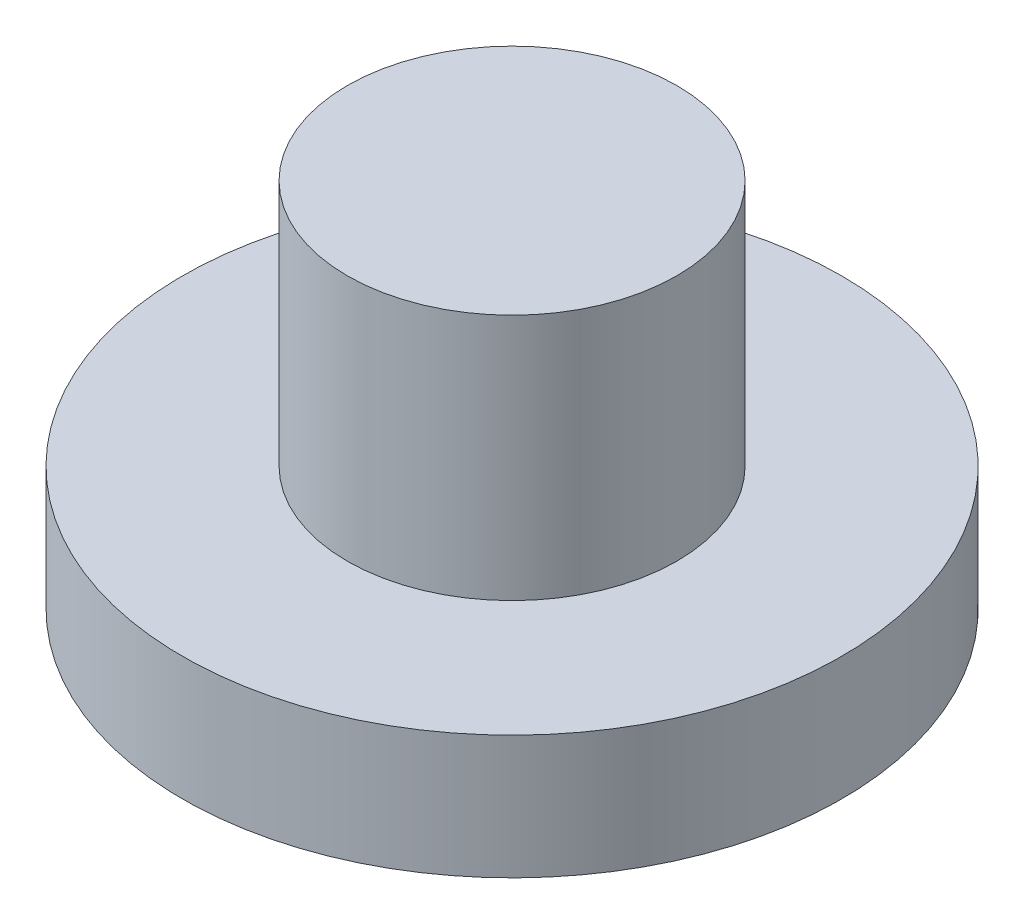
ISO-10303-21;
HEADER;
FILE_DESCRIPTION(('STEP AP214'),'2;1');
FILE_NAME('part.step','',(''),(''),'','','');
FILE_SCHEMA(('AUTOMOTIVE_DESIGN { 1 0 10303 214 1 1 1 1 }'));
ENDSEC;
DATA;
#1=APPLICATION_CONTEXT('core data for automotive mechanical design processes');
#2=APPLICATION_PROTOCOL_DEFINITION('international standard','automotive_design',2000,#1);
#3=PRODUCT_CONTEXT('',#1,'mechanical');
#4=PRODUCT('Part','Part','',(#3));
#5=PRODUCT_RELATED_PRODUCT_CATEGORY('part','',(#4));
#6=PRODUCT_DEFINITION_FORMATION('','',#4);
#7=PRODUCT_DEFINITION_CONTEXT('part definition',#1,'design');
#8=PRODUCT_DEFINITION('design','',#6,#7);
#9=PRODUCT_DEFINITION_SHAPE('','',#8);
#10=(LENGTH_UNIT() NAMED_UNIT(*) SI_UNIT(.MILLI.,.METRE.));
#11=(NAMED_UNIT(*) PLANE_ANGLE_UNIT() SI_UNIT($,.RADIAN.));
#12=(NAMED_UNIT(*) SI_UNIT($,.STERADIAN.) SOLID_ANGLE_UNIT());
#13=UNCERTAINTY_MEASURE_WITH_UNIT(LENGTH_MEASURE(1.E-05),#10,'distance_accuracy_value','');
#14=(GEOMETRIC_REPRESENTATION_CONTEXT(3) GLOBAL_UNCERTAINTY_ASSIGNED_CONTEXT((#13)) GLOBAL_UNIT_ASSIGNED_CONTEXT((#10,
#11,#12)) REPRESENTATION_CONTEXT('',''));
#15=CARTESIAN_POINT('',(0.,0.,0.));
#16=DIRECTION('',(0.,0.,1.));
#17=DIRECTION('',(1.,0.,0.));
#18=AXIS2_PLACEMENT_3D('',#15,#16,#17);
#19=CARTESIAN_POINT('',(0.,0.,0.));
#20=DIRECTION('',(0.,1.,0.));
#21=DIRECTION('',(0.,0.,1.));
#22=AXIS2_PLACEMENT_3D('',#19,#20,#21);
#23=PLANE('',#22);
#24=CARTESIAN_POINT('',(0.,0.,0.));
#25=DIRECTION('',(0.,-1.,0.));
#26=DIRECTION('',(0.,0.,-1.));
#27=AXIS2_PLACEMENT_3D('',#24,#25,#26);
#28=CIRCLE('',#27,40.);
#29=CARTESIAN_POINT('',(0.,0.,-40.));
#30=VERTEX_POINT('',#29);
#31=EDGE_CURVE('E10',#30,#30,#28,.T.);
#32=ORIENTED_EDGE('',*,*,#31,.T.);
#33=EDGE_LOOP('',(#32));
#34=FACE_BOUND('',#33,.T.);
#35=ADVANCED_FACE('F30',(#34),#23,.F.);
#36=CARTESIAN_POINT('',(0.,0.,0.));
#37=DIRECTION('',(0.,-1.,0.));
#38=DIRECTION('',(0.,0.,-1.));
#39=AXIS2_PLACEMENT_3D('',#36,#37,#38);
#40=CYLINDRICAL_SURFACE('',#39,40.);
#41=ORIENTED_EDGE('',*,*,#31,.F.);
#42=EDGE_LOOP('',(#41));
#43=FACE_BOUND('',#42,.T.);
#44=CARTESIAN_POINT('',(0.,15.,0.));
#45=DIRECTION('',(0.,-1.,0.));
#46=DIRECTION('',(0.,0.,-1.));
#47=AXIS2_PLACEMENT_3D('',#44,#45,#46);
#48=CIRCLE('',#47,40.);
#49=CARTESIAN_POINT('',(0.,15.,-40.));
#50=VERTEX_POINT('',#49);
#51=EDGE_CURVE('E36',#50,#50,#48,.T.);
#52=ORIENTED_EDGE('',*,*,#51,.T.);
#53=EDGE_LOOP('',(#52));
#54=FACE_BOUND('',#53,.T.);
#55=ADVANCED_FACE('F62',(#43,#54),#40,.T.);
#56=CARTESIAN_POINT('',(-40.,15.,0.));
#57=DIRECTION('',(0.,-1.,0.));
#58=DIRECTION('',(0.,0.,-1.));
#59=AXIS2_PLACEMENT_3D('',#56,#57,#58);
#60=PLANE('',#59);
#61=ORIENTED_EDGE('',*,*,#51,.F.);
#62=EDGE_LOOP('',(#61));
#63=FACE_BOUND('',#62,.T.);
#64=CARTESIAN_POINT('',(0.,15.,0.));
#65=DIRECTION('',(0.,-1.,0.));
#66=DIRECTION('',(0.,0.,-1.));
#67=AXIS2_PLACEMENT_3D('',#64,#65,#66);
#68=CIRCLE('',#67,20.);
#69=CARTESIAN_POINT('',(0.,15.,-20.));
#70=VERTEX_POINT('',#69);
#71=EDGE_CURVE('E40',#70,#70,#68,.T.);
#72=ORIENTED_EDGE('',*,*,#71,.T.);
#73=EDGE_LOOP('',(#72));
#74=FACE_BOUND('',#73,.T.);
#75=ADVANCED_FACE('F58',(#63,#74),#60,.F.);
#76=CARTESIAN_POINT('',(0.,0.,0.));
#77=DIRECTION('',(0.,-1.,0.));
#78=DIRECTION('',(0.,0.,-1.));
#79=AXIS2_PLACEMENT_3D('',#76,#77,#78);
#80=CYLINDRICAL_SURFACE('',#79,20.);
#81=ORIENTED_EDGE('',*,*,#71,.F.);
#82=EDGE_LOOP('',(#81));
#83=FACE_BOUND('',#82,.T.);
#84=CARTESIAN_POINT('',(0.,45.,0.));
#85=DIRECTION('',(0.,-1.,0.));
#86=DIRECTION('',(0.,0.,-1.));
#87=AXIS2_PLACEMENT_3D('',#84,#85,#86);
#88=CIRCLE('',#87,20.);
#89=CARTESIAN_POINT('',(0.,45.,-20.));
#90=VERTEX_POINT('',#89);
#91=EDGE_CURVE('E44',#90,#90,#88,.T.);
#92=ORIENTED_EDGE('',*,*,#91,.T.);
#93=EDGE_LOOP('',(#92));
#94=FACE_BOUND('',#93,.T.);
#95=ADVANCED_FACE('F50',(#83,#94),#80,.T.);
#96=CARTESIAN_POINT('',(-20.,45.,0.));
#97=DIRECTION('',(0.,-1.,0.));
#98=DIRECTION('',(0.,0.,-1.));
#99=AXIS2_PLACEMENT_3D('',#96,#97,#98);
#100=PLANE('',#99);
#101=ORIENTED_EDGE('',*,*,#91,.F.);
#102=EDGE_LOOP('',(#101));
#103=FACE_BOUND('',#102,.T.);
#104=ADVANCED_FACE('F52',(#103),#100,.F.);
#105=CLOSED_SHELL('',(#35,#55,#75,#95,#104));
#106=MANIFOLD_SOLID_BREP('B2',#105);
#107=ADVANCED_BREP_SHAPE_REPRESENTATION('',(#18,#106),#14);
#108=SHAPE_DEFINITION_REPRESENTATION(#9,#107);
ENDSEC;
END-ISO-10303-21;
